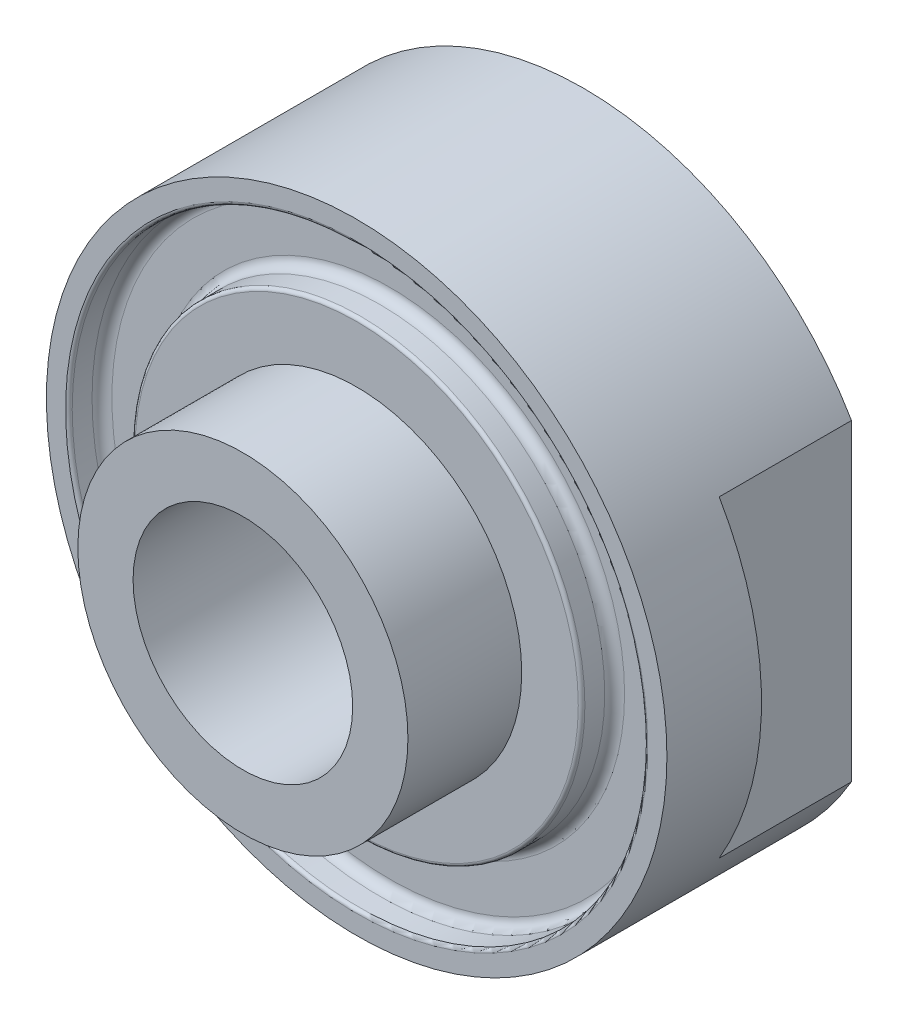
ISO-10303-21;
HEADER;
FILE_DESCRIPTION(('STEP AP214'),'2;1');
FILE_NAME('part.step','',(''),(''),'','','');
FILE_SCHEMA(('AUTOMOTIVE_DESIGN { 1 0 10303 214 1 1 1 1 }'));
ENDSEC;
DATA;
#1=APPLICATION_CONTEXT('core data for automotive mechanical design processes');
#2=APPLICATION_PROTOCOL_DEFINITION('international standard','automotive_design',2000,#1);
#3=PRODUCT_CONTEXT('',#1,'mechanical');
#4=PRODUCT('Part','Part','',(#3));
#5=PRODUCT_RELATED_PRODUCT_CATEGORY('part','',(#4));
#6=PRODUCT_DEFINITION_FORMATION('','',#4);
#7=PRODUCT_DEFINITION_CONTEXT('part definition',#1,'design');
#8=PRODUCT_DEFINITION('design','',#6,#7);
#9=PRODUCT_DEFINITION_SHAPE('','',#8);
#10=(LENGTH_UNIT() NAMED_UNIT(*) SI_UNIT(.MILLI.,.METRE.));
#11=(NAMED_UNIT(*) PLANE_ANGLE_UNIT() SI_UNIT($,.RADIAN.));
#12=(NAMED_UNIT(*) SI_UNIT($,.STERADIAN.) SOLID_ANGLE_UNIT());
#13=UNCERTAINTY_MEASURE_WITH_UNIT(LENGTH_MEASURE(1.E-05),#10,'distance_accuracy_value','');
#14=(GEOMETRIC_REPRESENTATION_CONTEXT(3) GLOBAL_UNCERTAINTY_ASSIGNED_CONTEXT((#13)) GLOBAL_UNIT_ASSIGNED_CONTEXT((#10,
#11,#12)) REPRESENTATION_CONTEXT('',''));
#15=CARTESIAN_POINT('',(0.,0.,0.));
#16=DIRECTION('',(0.,0.,1.));
#17=DIRECTION('',(1.,0.,0.));
#18=AXIS2_PLACEMENT_3D('',#15,#16,#17);
#19=CARTESIAN_POINT('',(0.,0.,8.7122));
#20=DIRECTION('',(0.,0.,1.));
#21=DIRECTION('',(1.,0.,0.));
#22=AXIS2_PLACEMENT_3D('',#19,#20,#21);
#23=PLANE('',#22);
#24=CARTESIAN_POINT('',(0.,0.,8.7122));
#25=DIRECTION('',(0.,0.,1.));
#26=DIRECTION('',(1.,0.,0.));
#27=AXIS2_PLACEMENT_3D('',#24,#25,#26);
#28=CIRCLE('',#27,8.509);
#29=CARTESIAN_POINT('',(8.509,0.,8.7122));
#30=VERTEX_POINT('',#29);
#31=EDGE_CURVE('E113',#30,#30,#28,.T.);
#32=ORIENTED_EDGE('',*,*,#31,.T.);
#33=EDGE_LOOP('',(#32));
#34=FACE_BOUND('',#33,.T.);
#35=CARTESIAN_POINT('',(0.,0.,8.7122));
#36=DIRECTION('',(0.,0.,1.));
#37=DIRECTION('',(1.,0.,0.));
#38=AXIS2_PLACEMENT_3D('',#35,#36,#37);
#39=CIRCLE('',#38,6.3373);
#40=CARTESIAN_POINT('',(6.3373,0.,8.7122));
#41=VERTEX_POINT('',#40);
#42=EDGE_CURVE('E89',#41,#41,#39,.T.);
#43=ORIENTED_EDGE('',*,*,#42,.F.);
#44=EDGE_LOOP('',(#43));
#45=FACE_BOUND('',#44,.T.);
#46=ADVANCED_FACE('F31',(#34,#45),#23,.T.);
#47=CARTESIAN_POINT('',(0.,0.,8.7122));
#48=DIRECTION('',(0.,0.,1.));
#49=DIRECTION('',(1.,0.,0.));
#50=AXIS2_PLACEMENT_3D('',#47,#48,#49);
#51=CIRCLE('',#50,11.176);
#52=CARTESIAN_POINT('',(11.176,0.,8.7122));
#53=VERTEX_POINT('',#52);
#54=EDGE_CURVE('E110',#53,#53,#51,.F.);
#55=ORIENTED_EDGE('',*,*,#54,.T.);
#56=EDGE_LOOP('',(#55));
#57=FACE_BOUND('',#56,.T.);
#58=CARTESIAN_POINT('',(0.,0.,8.7122));
#59=DIRECTION('',(0.,0.,1.));
#60=DIRECTION('',(1.,0.,0.));
#61=AXIS2_PLACEMENT_3D('',#58,#59,#60);
#62=CIRCLE('',#61,11.9126);
#63=CARTESIAN_POINT('',(11.9126,0.,8.7122));
#64=VERTEX_POINT('',#63);
#65=EDGE_CURVE('E87',#64,#64,#62,.T.);
#66=ORIENTED_EDGE('',*,*,#65,.T.);
#67=EDGE_LOOP('',(#66));
#68=FACE_BOUND('',#67,.T.);
#69=ADVANCED_FACE('F146',(#57,#68),#23,.T.);
#70=CARTESIAN_POINT('',(0.,0.,8.7122));
#71=DIRECTION('',(0.,0.,-1.));
#72=DIRECTION('',(-1.,0.,0.));
#73=AXIS2_PLACEMENT_3D('',#70,#71,#72);
#74=CYLINDRICAL_SURFACE('',#73,11.9126);
#75=ORIENTED_EDGE('',*,*,#65,.F.);
#76=EDGE_LOOP('',(#75));
#77=FACE_BOUND('',#76,.T.);
#78=CARTESIAN_POINT('',(0.,0.,5.08));
#79=DIRECTION('',(0.,0.,-1.));
#80=DIRECTION('',(-1.,0.,0.));
#81=AXIS2_PLACEMENT_3D('',#78,#79,#80);
#82=CIRCLE('',#81,11.9126);
#83=CARTESIAN_POINT('',(10.287,6.00730137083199,5.08));
#84=VERTEX_POINT('',#83);
#85=CARTESIAN_POINT('',(10.287,-6.00730137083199,5.08));
#86=VERTEX_POINT('',#85);
#87=EDGE_CURVE('E11',#84,#86,#82,.T.);
#88=ORIENTED_EDGE('',*,*,#87,.F.);
#89=DIRECTION('',(0.,0.,-1.));
#90=VECTOR('',#89,1.);
#91=CARTESIAN_POINT('',(10.287,6.00730137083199,8.7122));
#92=LINE('',#91,#90);
#93=CARTESIAN_POINT('',(10.287,6.00730137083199,0.));
#94=VERTEX_POINT('',#93);
#95=EDGE_CURVE('E72',#84,#94,#92,.T.);
#96=ORIENTED_EDGE('',*,*,#95,.T.);
#97=CARTESIAN_POINT('',(0.,0.,0.));
#98=DIRECTION('',(0.,0.,1.));
#99=DIRECTION('',(1.,0.,0.));
#100=AXIS2_PLACEMENT_3D('',#97,#98,#99);
#101=CIRCLE('',#100,11.9126);
#102=CARTESIAN_POINT('',(-10.287,6.00730137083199,0.));
#103=VERTEX_POINT('',#102);
#104=EDGE_CURVE('E54',#94,#103,#101,.T.);
#105=ORIENTED_EDGE('',*,*,#104,.T.);
#106=DIRECTION('',(0.,0.,-1.));
#107=VECTOR('',#106,1.);
#108=CARTESIAN_POINT('',(-10.287,6.00730137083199,8.7122));
#109=LINE('',#108,#107);
#110=CARTESIAN_POINT('',(-10.287,6.00730137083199,5.08));
#111=VERTEX_POINT('',#110);
#112=EDGE_CURVE('E123',#103,#111,#109,.F.);
#113=ORIENTED_EDGE('',*,*,#112,.T.);
#114=CARTESIAN_POINT('',(0.,0.,5.08));
#115=DIRECTION('',(0.,0.,1.));
#116=DIRECTION('',(1.,0.,0.));
#117=AXIS2_PLACEMENT_3D('',#114,#115,#116);
#118=CIRCLE('',#117,11.9126);
#119=CARTESIAN_POINT('',(-10.287,-6.00730137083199,5.08));
#120=VERTEX_POINT('',#119);
#121=EDGE_CURVE('E77',#111,#120,#118,.T.);
#122=ORIENTED_EDGE('',*,*,#121,.T.);
#123=DIRECTION('',(0.,0.,-1.));
#124=VECTOR('',#123,1.);
#125=CARTESIAN_POINT('',(-10.287,-6.00730137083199,8.7122));
#126=LINE('',#125,#124);
#127=CARTESIAN_POINT('',(-10.287,-6.00730137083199,0.));
#128=VERTEX_POINT('',#127);
#129=EDGE_CURVE('E122',#120,#128,#126,.T.);
#130=ORIENTED_EDGE('',*,*,#129,.T.);
#131=CARTESIAN_POINT('',(10.287,-6.00730137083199,0.));
#132=VERTEX_POINT('',#131);
#133=EDGE_CURVE('E84',#128,#132,#101,.T.);
#134=ORIENTED_EDGE('',*,*,#133,.T.);
#135=DIRECTION('',(0.,0.,-1.));
#136=VECTOR('',#135,1.);
#137=CARTESIAN_POINT('',(10.287,-6.00730137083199,8.7122));
#138=LINE('',#137,#136);
#139=EDGE_CURVE('E46',#132,#86,#138,.F.);
#140=ORIENTED_EDGE('',*,*,#139,.T.);
#141=EDGE_LOOP('',(#88,#96,#105,#113,#122,#130,#134,#140));
#142=FACE_BOUND('',#141,.T.);
#143=ADVANCED_FACE('F33',(#77,#142),#74,.T.);
#144=CARTESIAN_POINT('',(0.,0.,0.));
#145=DIRECTION('',(0.,0.,1.));
#146=DIRECTION('',(1.,0.,0.));
#147=AXIS2_PLACEMENT_3D('',#144,#145,#146);
#148=PLANE('',#147);
#149=CARTESIAN_POINT('',(0.,0.,0.));
#150=DIRECTION('',(0.,0.,1.));
#151=DIRECTION('',(1.,0.,0.));
#152=AXIS2_PLACEMENT_3D('',#149,#150,#151);
#153=CIRCLE('',#152,4.2164);
#154=CARTESIAN_POINT('',(4.2164,0.,0.));
#155=VERTEX_POINT('',#154);
#156=EDGE_CURVE('E138',#155,#155,#153,.T.);
#157=ORIENTED_EDGE('',*,*,#156,.T.);
#158=EDGE_LOOP('',(#157));
#159=FACE_BOUND('',#158,.T.);
#160=ORIENTED_EDGE('',*,*,#104,.F.);
#161=DIRECTION('',(0.,-1.,0.));
#162=VECTOR('',#161,1.);
#163=CARTESIAN_POINT('',(10.287,0.,0.));
#164=LINE('',#163,#162);
#165=EDGE_CURVE('E39',#94,#132,#164,.T.);
#166=ORIENTED_EDGE('',*,*,#165,.T.);
#167=ORIENTED_EDGE('',*,*,#133,.F.);
#168=DIRECTION('',(0.,1.,0.));
#169=VECTOR('',#168,1.);
#170=CARTESIAN_POINT('',(-10.287,0.,0.));
#171=LINE('',#170,#169);
#172=EDGE_CURVE('E83',#128,#103,#171,.T.);
#173=ORIENTED_EDGE('',*,*,#172,.T.);
#174=EDGE_LOOP('',(#160,#166,#167,#173));
#175=FACE_BOUND('',#174,.T.);
#176=ADVANCED_FACE('F82',(#159,#175),#148,.F.);
#177=CARTESIAN_POINT('',(0.,0.,13.081));
#178=DIRECTION('',(0.,0.,-1.));
#179=DIRECTION('',(-1.,0.,0.));
#180=AXIS2_PLACEMENT_3D('',#177,#178,#179);
#181=CYLINDRICAL_SURFACE('',#180,6.3373);
#182=CARTESIAN_POINT('',(0.,0.,13.081));
#183=DIRECTION('',(0.,0.,1.));
#184=DIRECTION('',(1.,0.,0.));
#185=AXIS2_PLACEMENT_3D('',#182,#183,#184);
#186=CIRCLE('',#185,6.3373);
#187=CARTESIAN_POINT('',(6.3373,0.,13.081));
#188=VERTEX_POINT('',#187);
#189=EDGE_CURVE('E85',#188,#188,#186,.T.);
#190=ORIENTED_EDGE('',*,*,#189,.F.);
#191=EDGE_LOOP('',(#190));
#192=FACE_BOUND('',#191,.T.);
#193=ORIENTED_EDGE('',*,*,#42,.T.);
#194=EDGE_LOOP('',(#193));
#195=FACE_BOUND('',#194,.T.);
#196=ADVANCED_FACE('F143',(#192,#195),#181,.T.);
#197=CARTESIAN_POINT('',(0.,0.,13.081));
#198=DIRECTION('',(0.,0.,1.));
#199=DIRECTION('',(1.,0.,0.));
#200=AXIS2_PLACEMENT_3D('',#197,#198,#199);
#201=PLANE('',#200);
#202=CARTESIAN_POINT('',(0.,0.,13.081));
#203=DIRECTION('',(0.,0.,1.));
#204=DIRECTION('',(1.,0.,0.));
#205=AXIS2_PLACEMENT_3D('',#202,#203,#204);
#206=CIRCLE('',#205,4.2164);
#207=CARTESIAN_POINT('',(4.2164,0.,13.081));
#208=VERTEX_POINT('',#207);
#209=EDGE_CURVE('E135',#208,#208,#206,.T.);
#210=ORIENTED_EDGE('',*,*,#209,.F.);
#211=EDGE_LOOP('',(#210));
#212=FACE_BOUND('',#211,.T.);
#213=ORIENTED_EDGE('',*,*,#189,.T.);
#214=EDGE_LOOP('',(#213));
#215=FACE_BOUND('',#214,.T.);
#216=ADVANCED_FACE('F158',(#212,#215),#201,.T.);
#217=CARTESIAN_POINT('',(0.,0.,0.));
#218=DIRECTION('',(0.,0.,1.));
#219=DIRECTION('',(1.,0.,0.));
#220=AXIS2_PLACEMENT_3D('',#217,#218,#219);
#221=CYLINDRICAL_SURFACE('',#220,4.2164);
#222=ORIENTED_EDGE('',*,*,#156,.F.);
#223=EDGE_LOOP('',(#222));
#224=FACE_BOUND('',#223,.T.);
#225=ORIENTED_EDGE('',*,*,#209,.T.);
#226=EDGE_LOOP('',(#225));
#227=FACE_BOUND('',#226,.T.);
#228=ADVANCED_FACE('F162',(#224,#227),#221,.F.);
#229=CARTESIAN_POINT('',(0.,0.,7.4422));
#230=DIRECTION('',(0.,0.,1.));
#231=DIRECTION('',(1.,0.,0.));
#232=AXIS2_PLACEMENT_3D('',#229,#230,#231);
#233=CYLINDRICAL_SURFACE('',#232,11.049);
#234=CARTESIAN_POINT('',(0.,0.,8.5852));
#235=DIRECTION('',(0.,0.,1.));
#236=DIRECTION('',(1.,0.,0.));
#237=AXIS2_PLACEMENT_3D('',#234,#235,#236);
#238=CIRCLE('',#237,11.049);
#239=CARTESIAN_POINT('',(11.049,0.,8.5852));
#240=VERTEX_POINT('',#239);
#241=EDGE_CURVE('E107',#240,#240,#238,.T.);
#242=ORIENTED_EDGE('',*,*,#241,.T.);
#243=EDGE_LOOP('',(#242));
#244=FACE_BOUND('',#243,.T.);
#245=CARTESIAN_POINT('',(0.,0.,7.8232));
#246=DIRECTION('',(0.,0.,1.));
#247=DIRECTION('',(1.,0.,0.));
#248=AXIS2_PLACEMENT_3D('',#245,#246,#247);
#249=CIRCLE('',#248,11.049);
#250=CARTESIAN_POINT('',(11.049,0.,7.8232));
#251=VERTEX_POINT('',#250);
#252=EDGE_CURVE('E101',#251,#251,#249,.F.);
#253=ORIENTED_EDGE('',*,*,#252,.T.);
#254=EDGE_LOOP('',(#253));
#255=FACE_BOUND('',#254,.T.);
#256=ADVANCED_FACE('F166',(#244,#255),#233,.F.);
#257=CARTESIAN_POINT('',(0.,0.,7.4422));
#258=DIRECTION('',(0.,0.,1.));
#259=DIRECTION('',(1.,0.,0.));
#260=AXIS2_PLACEMENT_3D('',#257,#258,#259);
#261=PLANE('',#260);
#262=CARTESIAN_POINT('',(0.,0.,7.4422));
#263=DIRECTION('',(0.,0.,1.));
#264=DIRECTION('',(1.,0.,0.));
#265=AXIS2_PLACEMENT_3D('',#262,#263,#264);
#266=CIRCLE('',#265,10.668);
#267=CARTESIAN_POINT('',(10.668,0.,7.4422));
#268=VERTEX_POINT('',#267);
#269=EDGE_CURVE('E98',#268,#268,#266,.T.);
#270=ORIENTED_EDGE('',*,*,#269,.T.);
#271=EDGE_LOOP('',(#270));
#272=FACE_BOUND('',#271,.T.);
#273=CARTESIAN_POINT('',(0.,0.,7.4422));
#274=DIRECTION('',(0.,0.,1.));
#275=DIRECTION('',(1.,0.,0.));
#276=AXIS2_PLACEMENT_3D('',#273,#274,#275);
#277=CIRCLE('',#276,9.017);
#278=CARTESIAN_POINT('',(9.017,0.,7.4422));
#279=VERTEX_POINT('',#278);
#280=EDGE_CURVE('E95',#279,#279,#277,.F.);
#281=ORIENTED_EDGE('',*,*,#280,.T.);
#282=EDGE_LOOP('',(#281));
#283=FACE_BOUND('',#282,.T.);
#284=ADVANCED_FACE('F170',(#272,#283),#261,.T.);
#285=CARTESIAN_POINT('',(0.,0.,7.4422));
#286=DIRECTION('',(0.,0.,1.));
#287=DIRECTION('',(1.,0.,0.));
#288=AXIS2_PLACEMENT_3D('',#285,#286,#287);
#289=CYLINDRICAL_SURFACE('',#288,8.636);
#290=CARTESIAN_POINT('',(0.,0.,8.5852));
#291=DIRECTION('',(0.,0.,1.));
#292=DIRECTION('',(1.,0.,0.));
#293=AXIS2_PLACEMENT_3D('',#290,#291,#292);
#294=CIRCLE('',#293,8.636);
#295=CARTESIAN_POINT('',(8.636,0.,8.5852));
#296=VERTEX_POINT('',#295);
#297=EDGE_CURVE('E116',#296,#296,#294,.F.);
#298=ORIENTED_EDGE('',*,*,#297,.T.);
#299=EDGE_LOOP('',(#298));
#300=FACE_BOUND('',#299,.T.);
#301=CARTESIAN_POINT('',(0.,0.,7.8232));
#302=DIRECTION('',(0.,0.,1.));
#303=DIRECTION('',(1.,0.,0.));
#304=AXIS2_PLACEMENT_3D('',#301,#302,#303);
#305=CIRCLE('',#304,8.636);
#306=CARTESIAN_POINT('',(8.636,0.,7.8232));
#307=VERTEX_POINT('',#306);
#308=EDGE_CURVE('E104',#307,#307,#305,.T.);
#309=ORIENTED_EDGE('',*,*,#308,.T.);
#310=EDGE_LOOP('',(#309));
#311=FACE_BOUND('',#310,.T.);
#312=ADVANCED_FACE('F174',(#300,#311),#289,.T.);
#313=CARTESIAN_POINT('',(0.,0.,7.8232));
#314=DIRECTION('',(0.,0.,1.));
#315=DIRECTION('',(1.,0.,0.));
#316=AXIS2_PLACEMENT_3D('',#313,#314,#315);
#317=TOROIDAL_SURFACE('',#316,10.668,0.381);
#318=ORIENTED_EDGE('',*,*,#252,.F.);
#319=EDGE_LOOP('',(#318));
#320=FACE_BOUND('',#319,.T.);
#321=ORIENTED_EDGE('',*,*,#269,.F.);
#322=EDGE_LOOP('',(#321));
#323=FACE_BOUND('',#322,.T.);
#324=ADVANCED_FACE('F178',(#320,#323),#317,.F.);
#325=CARTESIAN_POINT('',(0.,0.,7.8232));
#326=DIRECTION('',(0.,0.,1.));
#327=DIRECTION('',(1.,0.,0.));
#328=AXIS2_PLACEMENT_3D('',#325,#326,#327);
#329=TOROIDAL_SURFACE('',#328,9.017,0.381);
#330=ORIENTED_EDGE('',*,*,#280,.F.);
#331=EDGE_LOOP('',(#330));
#332=FACE_BOUND('',#331,.T.);
#333=ORIENTED_EDGE('',*,*,#308,.F.);
#334=EDGE_LOOP('',(#333));
#335=FACE_BOUND('',#334,.T.);
#336=ADVANCED_FACE('F182',(#332,#335),#329,.F.);
#337=CARTESIAN_POINT('',(0.,0.,8.5852));
#338=DIRECTION('',(0.,0.,1.));
#339=DIRECTION('',(1.,0.,0.));
#340=AXIS2_PLACEMENT_3D('',#337,#338,#339);
#341=TOROIDAL_SURFACE('',#340,11.176,0.127);
#342=ORIENTED_EDGE('',*,*,#54,.F.);
#343=EDGE_LOOP('',(#342));
#344=FACE_BOUND('',#343,.T.);
#345=ORIENTED_EDGE('',*,*,#241,.F.);
#346=EDGE_LOOP('',(#345));
#347=FACE_BOUND('',#346,.T.);
#348=ADVANCED_FACE('F186',(#344,#347),#341,.T.);
#349=CARTESIAN_POINT('',(0.,0.,8.5852));
#350=DIRECTION('',(0.,0.,1.));
#351=DIRECTION('',(1.,0.,0.));
#352=AXIS2_PLACEMENT_3D('',#349,#350,#351);
#353=TOROIDAL_SURFACE('',#352,8.509,0.127);
#354=ORIENTED_EDGE('',*,*,#297,.F.);
#355=EDGE_LOOP('',(#354));
#356=FACE_BOUND('',#355,.T.);
#357=ORIENTED_EDGE('',*,*,#31,.F.);
#358=EDGE_LOOP('',(#357));
#359=FACE_BOUND('',#358,.T.);
#360=ADVANCED_FACE('F190',(#356,#359),#353,.T.);
#361=CARTESIAN_POINT('',(-10.287,13.0060270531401,5.08));
#362=DIRECTION('',(0.,0.,1.));
#363=DIRECTION('',(1.,0.,0.));
#364=AXIS2_PLACEMENT_3D('',#361,#362,#363);
#365=PLANE('',#364);
#366=DIRECTION('',(0.,-1.,0.));
#367=VECTOR('',#366,1.);
#368=CARTESIAN_POINT('',(-10.287,13.0060270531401,5.08));
#369=LINE('',#368,#367);
#370=EDGE_CURVE('E79',#111,#120,#369,.T.);
#371=ORIENTED_EDGE('',*,*,#370,.T.);
#372=ORIENTED_EDGE('',*,*,#121,.F.);
#373=EDGE_LOOP('',(#371,#372));
#374=FACE_BOUND('',#373,.T.);
#375=ADVANCED_FACE('F127',(#374),#365,.F.);
#376=CARTESIAN_POINT('',(-10.287,13.0060270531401,5.08));
#377=DIRECTION('',(1.,0.,0.));
#378=DIRECTION('',(0.,0.,-1.));
#379=AXIS2_PLACEMENT_3D('',#376,#377,#378);
#380=PLANE('',#379);
#381=ORIENTED_EDGE('',*,*,#370,.F.);
#382=ORIENTED_EDGE('',*,*,#112,.F.);
#383=ORIENTED_EDGE('',*,*,#172,.F.);
#384=ORIENTED_EDGE('',*,*,#129,.F.);
#385=EDGE_LOOP('',(#381,#382,#383,#384));
#386=FACE_BOUND('',#385,.T.);
#387=ADVANCED_FACE('F129',(#386),#380,.F.);
#388=CARTESIAN_POINT('',(10.287,13.0060270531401,5.08));
#389=DIRECTION('',(0.,0.,-1.));
#390=DIRECTION('',(-1.,0.,0.));
#391=AXIS2_PLACEMENT_3D('',#388,#389,#390);
#392=PLANE('',#391);
#393=ORIENTED_EDGE('',*,*,#87,.T.);
#394=DIRECTION('',(0.,1.,0.));
#395=VECTOR('',#394,1.);
#396=CARTESIAN_POINT('',(10.287,13.0060270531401,5.08));
#397=LINE('',#396,#395);
#398=EDGE_CURVE('E206',#86,#84,#397,.T.);
#399=ORIENTED_EDGE('',*,*,#398,.T.);
#400=EDGE_LOOP('',(#393,#399));
#401=FACE_BOUND('',#400,.T.);
#402=ADVANCED_FACE('F197',(#401),#392,.T.);
#403=CARTESIAN_POINT('',(10.287,13.0060270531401,5.08));
#404=DIRECTION('',(-1.,0.,0.));
#405=DIRECTION('',(0.,0.,1.));
#406=AXIS2_PLACEMENT_3D('',#403,#404,#405);
#407=PLANE('',#406);
#408=ORIENTED_EDGE('',*,*,#398,.F.);
#409=ORIENTED_EDGE('',*,*,#139,.F.);
#410=ORIENTED_EDGE('',*,*,#165,.F.);
#411=ORIENTED_EDGE('',*,*,#95,.F.);
#412=EDGE_LOOP('',(#408,#409,#410,#411));
#413=FACE_BOUND('',#412,.T.);
#414=ADVANCED_FACE('F71',(#413),#407,.F.);
#415=CLOSED_SHELL('',(#46,#69,#143,#176,#196,#216,#228,#256,#284,#312,#324,#336,#348,#360,#375,
#387,#402,#414));
#416=MANIFOLD_SOLID_BREP('B2',#415);
#417=ADVANCED_BREP_SHAPE_REPRESENTATION('',(#18,#416),#14);
#418=SHAPE_DEFINITION_REPRESENTATION(#9,#417);
ENDSEC;
END-ISO-10303-21;
